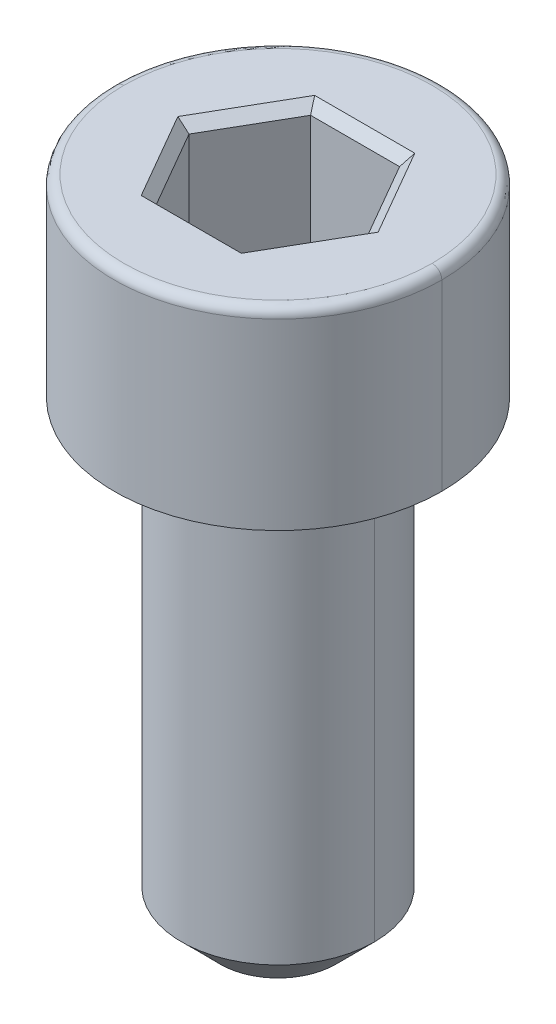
ISO-10303-21;
HEADER;
FILE_DESCRIPTION(('STEP AP214'),'2;1');
FILE_NAME('part.step','',(''),(''),'','','');
FILE_SCHEMA(('AUTOMOTIVE_DESIGN { 1 0 10303 214 1 1 1 1 }'));
ENDSEC;
DATA;
#1=APPLICATION_CONTEXT('core data for automotive mechanical design processes');
#2=APPLICATION_PROTOCOL_DEFINITION('international standard','automotive_design',2000,#1);
#3=PRODUCT_CONTEXT('',#1,'mechanical');
#4=PRODUCT('Part','Part','',(#3));
#5=PRODUCT_RELATED_PRODUCT_CATEGORY('part','',(#4));
#6=PRODUCT_DEFINITION_FORMATION('','',#4);
#7=PRODUCT_DEFINITION_CONTEXT('part definition',#1,'design');
#8=PRODUCT_DEFINITION('design','',#6,#7);
#9=PRODUCT_DEFINITION_SHAPE('','',#8);
#10=(LENGTH_UNIT() NAMED_UNIT(*) SI_UNIT(.MILLI.,.METRE.));
#11=(NAMED_UNIT(*) PLANE_ANGLE_UNIT() SI_UNIT($,.RADIAN.));
#12=(NAMED_UNIT(*) SI_UNIT($,.STERADIAN.) SOLID_ANGLE_UNIT());
#13=UNCERTAINTY_MEASURE_WITH_UNIT(LENGTH_MEASURE(1.E-05),#10,'distance_accuracy_value','');
#14=(GEOMETRIC_REPRESENTATION_CONTEXT(3) GLOBAL_UNCERTAINTY_ASSIGNED_CONTEXT((#13)) GLOBAL_UNIT_ASSIGNED_CONTEXT((#10,
#11,#12)) REPRESENTATION_CONTEXT('',''));
#15=CARTESIAN_POINT('',(0.,0.,0.));
#16=DIRECTION('',(0.,0.,1.));
#17=DIRECTION('',(1.,0.,0.));
#18=AXIS2_PLACEMENT_3D('',#15,#16,#17);
#19=CARTESIAN_POINT('',(-58.8452994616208,56.75,-9.25));
#20=DIRECTION('',(0.,-0.707106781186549,-0.707106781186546));
#21=DIRECTION('',(-1.,0.,0.));
#22=AXIS2_PLACEMENT_3D('',#19,#20,#21);
#23=PLANE('',#22);
#24=DIRECTION('',(0.377964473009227,0.654653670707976,-0.654653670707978));
#25=VECTOR('',#24,1.);
#26=CARTESIAN_POINT('',(-58.8452994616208,56.75,-9.25));
#27=LINE('',#26,#25);
#28=CARTESIAN_POINT('',(-58.8452994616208,56.75,-9.25));
#29=VERTEX_POINT('',#28);
#30=CARTESIAN_POINT('',(-58.7009618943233,57.,-9.5));
#31=VERTEX_POINT('',#30);
#32=EDGE_CURVE('E24',#29,#31,#27,.T.);
#33=ORIENTED_EDGE('',*,*,#32,.T.);
#34=DIRECTION('',(1.,0.,0.));
#35=VECTOR('',#34,1.);
#36=CARTESIAN_POINT('',(-60.,57.,-9.5));
#37=LINE('',#36,#35);
#38=CARTESIAN_POINT('',(-61.2990381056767,57.,-9.5));
#39=VERTEX_POINT('',#38);
#40=EDGE_CURVE('E184',#39,#31,#37,.T.);
#41=ORIENTED_EDGE('',*,*,#40,.F.);
#42=DIRECTION('',(0.377964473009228,-0.654653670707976,0.654653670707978));
#43=VECTOR('',#42,1.);
#44=CARTESIAN_POINT('',(-60.8247860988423,56.1785714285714,-8.67857142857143));
#45=LINE('',#44,#43);
#46=CARTESIAN_POINT('',(-61.1547005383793,56.75,-9.25));
#47=VERTEX_POINT('',#46);
#48=EDGE_CURVE('E11',#39,#47,#45,.T.);
#49=ORIENTED_EDGE('',*,*,#48,.T.);
#50=DIRECTION('',(-1.,0.,0.));
#51=VECTOR('',#50,1.);
#52=CARTESIAN_POINT('',(-58.8452994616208,56.75,-9.25));
#53=LINE('',#52,#51);
#54=EDGE_CURVE('E187',#29,#47,#53,.T.);
#55=ORIENTED_EDGE('',*,*,#54,.F.);
#56=EDGE_LOOP('',(#33,#41,#49,#55));
#57=FACE_BOUND('',#56,.T.);
#58=ADVANCED_FACE('F16',(#57),#23,.F.);
#59=CARTESIAN_POINT('',(-61.1547005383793,56.75,-9.25));
#60=DIRECTION('',(-0.612372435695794,-0.707106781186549,-0.353553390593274));
#61=DIRECTION('',(-0.5,0.,0.866025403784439));
#62=AXIS2_PLACEMENT_3D('',#59,#60,#61);
#63=PLANE('',#62);
#64=DIRECTION('',(0.755928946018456,-0.654653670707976,0.));
#65=VECTOR('',#64,1.);
#66=CARTESIAN_POINT('',(-62.3094010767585,56.75,-7.25));
#67=LINE('',#66,#65);
#68=CARTESIAN_POINT('',(-62.5980762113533,57.,-7.25));
#69=VERTEX_POINT('',#68);
#70=CARTESIAN_POINT('',(-62.3094010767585,56.75,-7.25));
#71=VERTEX_POINT('',#70);
#72=EDGE_CURVE('E193',#69,#71,#67,.T.);
#73=ORIENTED_EDGE('',*,*,#72,.T.);
#74=DIRECTION('',(-0.5,0.,0.866025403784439));
#75=VECTOR('',#74,1.);
#76=CARTESIAN_POINT('',(-61.1547005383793,56.75,-9.25));
#77=LINE('',#76,#75);
#78=EDGE_CURVE('E299',#47,#71,#77,.T.);
#79=ORIENTED_EDGE('',*,*,#78,.F.);
#80=ORIENTED_EDGE('',*,*,#48,.F.);
#81=DIRECTION('',(0.5,0.,-0.866025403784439));
#82=VECTOR('',#81,1.);
#83=CARTESIAN_POINT('',(-61.948557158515,57.,-8.375));
#84=LINE('',#83,#82);
#85=EDGE_CURVE('E209',#69,#39,#84,.T.);
#86=ORIENTED_EDGE('',*,*,#85,.F.);
#87=EDGE_LOOP('',(#73,#79,#80,#86));
#88=FACE_BOUND('',#87,.T.);
#89=ADVANCED_FACE('F526',(#88),#63,.F.);
#90=CARTESIAN_POINT('',(-57.6905989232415,56.75,-7.25));
#91=DIRECTION('',(0.612372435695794,-0.707106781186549,-0.353553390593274));
#92=DIRECTION('',(-0.5,0.,-0.866025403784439));
#93=AXIS2_PLACEMENT_3D('',#90,#91,#92);
#94=PLANE('',#93);
#95=DIRECTION('',(0.755928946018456,0.654653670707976,0.));
#96=VECTOR('',#95,1.);
#97=CARTESIAN_POINT('',(-57.6905989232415,56.75,-7.25));
#98=LINE('',#97,#96);
#99=CARTESIAN_POINT('',(-57.6905989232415,56.75,-7.25));
#100=VERTEX_POINT('',#99);
#101=CARTESIAN_POINT('',(-57.4019237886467,57.,-7.25));
#102=VERTEX_POINT('',#101);
#103=EDGE_CURVE('E198',#100,#102,#98,.T.);
#104=ORIENTED_EDGE('',*,*,#103,.T.);
#105=DIRECTION('',(0.5,0.,0.866025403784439));
#106=VECTOR('',#105,1.);
#107=CARTESIAN_POINT('',(-58.051442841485,57.,-8.375));
#108=LINE('',#107,#106);
#109=EDGE_CURVE('E196',#31,#102,#108,.T.);
#110=ORIENTED_EDGE('',*,*,#109,.F.);
#111=ORIENTED_EDGE('',*,*,#32,.F.);
#112=DIRECTION('',(-0.5,0.,-0.866025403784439));
#113=VECTOR('',#112,1.);
#114=CARTESIAN_POINT('',(-57.6905989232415,56.75,-7.25));
#115=LINE('',#114,#113);
#116=EDGE_CURVE('E261',#100,#29,#115,.T.);
#117=ORIENTED_EDGE('',*,*,#116,.F.);
#118=EDGE_LOOP('',(#104,#110,#111,#117));
#119=FACE_BOUND('',#118,.T.);
#120=ADVANCED_FACE('F197',(#119),#94,.F.);
#121=CARTESIAN_POINT('',(-62.3094010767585,56.75,-7.25));
#122=DIRECTION('',(-0.612372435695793,-0.707106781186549,0.353553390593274));
#123=DIRECTION('',(0.5,0.,0.866025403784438));
#124=AXIS2_PLACEMENT_3D('',#121,#122,#123);
#125=PLANE('',#124);
#126=DIRECTION('',(0.377964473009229,-0.654653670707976,-0.654653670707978));
#127=VECTOR('',#126,1.);
#128=CARTESIAN_POINT('',(-61.1547005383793,56.75,-5.25));
#129=LINE('',#128,#127);
#130=CARTESIAN_POINT('',(-61.2990381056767,57.,-5.));
#131=VERTEX_POINT('',#130);
#132=CARTESIAN_POINT('',(-61.1547005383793,56.75,-5.25));
#133=VERTEX_POINT('',#132);
#134=EDGE_CURVE('E251',#131,#133,#129,.T.);
#135=ORIENTED_EDGE('',*,*,#134,.T.);
#136=DIRECTION('',(0.5,0.,0.866025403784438));
#137=VECTOR('',#136,1.);
#138=CARTESIAN_POINT('',(-62.3094010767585,56.75,-7.25));
#139=LINE('',#138,#137);
#140=EDGE_CURVE('E294',#71,#133,#139,.T.);
#141=ORIENTED_EDGE('',*,*,#140,.F.);
#142=ORIENTED_EDGE('',*,*,#72,.F.);
#143=DIRECTION('',(-0.5,0.,-0.866025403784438));
#144=VECTOR('',#143,1.);
#145=CARTESIAN_POINT('',(-61.948557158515,57.,-6.125));
#146=LINE('',#145,#144);
#147=EDGE_CURVE('E235',#131,#69,#146,.T.);
#148=ORIENTED_EDGE('',*,*,#147,.F.);
#149=EDGE_LOOP('',(#135,#141,#142,#148));
#150=FACE_BOUND('',#149,.T.);
#151=ADVANCED_FACE('F370',(#150),#125,.F.);
#152=CARTESIAN_POINT('',(-58.8452994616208,56.75,-5.25));
#153=DIRECTION('',(0.612372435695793,-0.707106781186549,0.353553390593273));
#154=DIRECTION('',(0.5,0.,-0.866025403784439));
#155=AXIS2_PLACEMENT_3D('',#152,#153,#154);
#156=PLANE('',#155);
#157=DIRECTION('',(0.377964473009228,0.654653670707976,0.654653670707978));
#158=VECTOR('',#157,1.);
#159=CARTESIAN_POINT('',(-58.8452994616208,56.75,-5.25));
#160=LINE('',#159,#158);
#161=CARTESIAN_POINT('',(-58.8452994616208,56.75,-5.25));
#162=VERTEX_POINT('',#161);
#163=CARTESIAN_POINT('',(-58.7009618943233,57.,-5.));
#164=VERTEX_POINT('',#163);
#165=EDGE_CURVE('E248',#162,#164,#160,.T.);
#166=ORIENTED_EDGE('',*,*,#165,.T.);
#167=DIRECTION('',(-0.5,0.,0.866025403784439));
#168=VECTOR('',#167,1.);
#169=CARTESIAN_POINT('',(-58.051442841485,57.,-6.125));
#170=LINE('',#169,#168);
#171=EDGE_CURVE('E203',#102,#164,#170,.T.);
#172=ORIENTED_EDGE('',*,*,#171,.F.);
#173=ORIENTED_EDGE('',*,*,#103,.F.);
#174=DIRECTION('',(0.5,0.,-0.866025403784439));
#175=VECTOR('',#174,1.);
#176=CARTESIAN_POINT('',(-58.8452994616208,56.75,-5.25));
#177=LINE('',#176,#175);
#178=EDGE_CURVE('E270',#162,#100,#177,.T.);
#179=ORIENTED_EDGE('',*,*,#178,.F.);
#180=EDGE_LOOP('',(#166,#172,#173,#179));
#181=FACE_BOUND('',#180,.T.);
#182=ADVANCED_FACE('F552',(#181),#156,.F.);
#183=CARTESIAN_POINT('',(-61.1547005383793,56.75,-5.25));
#184=DIRECTION('',(0.,-0.707106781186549,0.707106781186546));
#185=DIRECTION('',(1.,0.,0.));
#186=AXIS2_PLACEMENT_3D('',#183,#184,#185);
#187=PLANE('',#186);
#188=ORIENTED_EDGE('',*,*,#134,.F.);
#189=DIRECTION('',(-1.,0.,0.));
#190=VECTOR('',#189,1.);
#191=CARTESIAN_POINT('',(-60.,57.,-5.));
#192=LINE('',#191,#190);
#193=EDGE_CURVE('E231',#164,#131,#192,.T.);
#194=ORIENTED_EDGE('',*,*,#193,.F.);
#195=ORIENTED_EDGE('',*,*,#165,.F.);
#196=DIRECTION('',(1.,0.,0.));
#197=VECTOR('',#196,1.);
#198=CARTESIAN_POINT('',(-61.1547005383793,56.75,-5.25));
#199=LINE('',#198,#197);
#200=EDGE_CURVE('E282',#133,#162,#199,.T.);
#201=ORIENTED_EDGE('',*,*,#200,.F.);
#202=EDGE_LOOP('',(#188,#194,#195,#201));
#203=FACE_BOUND('',#202,.T.);
#204=ADVANCED_FACE('F379',(#203),#187,.F.);
#205=CARTESIAN_POINT('',(-57.9071052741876,53.75,-7.375));
#206=DIRECTION('',(0.5,0.,-0.866025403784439));
#207=DIRECTION('',(0.866025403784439,0.,0.5));
#208=AXIS2_PLACEMENT_3D('',#205,#206,#207);
#209=CYLINDRICAL_SURFACE('',#208,0.25);
#210=CARTESIAN_POINT('',(-58.9896370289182,53.5,-5.5));
#211=CARTESIAN_POINT('',(-58.9050860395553,53.5,-5.35355339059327));
#212=CARTESIAN_POINT('',(-58.8452994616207,53.6035533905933,-5.25));
#213=CARTESIAN_POINT('',(-58.8452994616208,53.75,-5.25));
#214=(BOUNDED_CURVE() B_SPLINE_CURVE(3,(#210,#211,#212,#213),.UNSPECIFIED.,.F.,
.F.) B_SPLINE_CURVE_WITH_KNOTS((4,4),(1.5707963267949,3.1415926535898),
.UNSPECIFIED.) CURVE() GEOMETRIC_REPRESENTATION_ITEM() RATIONAL_B_SPLINE_CURVE((1.,
0.804737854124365,0.804737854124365,1.)) REPRESENTATION_ITEM(''));
#215=CARTESIAN_POINT('',(-58.9896370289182,53.5,-5.5));
#216=VERTEX_POINT('',#215);
#217=CARTESIAN_POINT('',(-58.8452994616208,53.75,-5.25));
#218=VERTEX_POINT('',#217);
#219=EDGE_CURVE('E347',#216,#218,#214,.T.);
#220=ORIENTED_EDGE('',*,*,#219,.T.);
#221=DIRECTION('',(-0.5,0.,0.866025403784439));
#222=VECTOR('',#221,1.);
#223=CARTESIAN_POINT('',(-58.8452994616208,53.75,-5.25));
#224=LINE('',#223,#222);
#225=CARTESIAN_POINT('',(-57.6905989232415,53.75,-7.25));
#226=VERTEX_POINT('',#225);
#227=EDGE_CURVE('E274',#226,#218,#224,.T.);
#228=ORIENTED_EDGE('',*,*,#227,.F.);
#229=CARTESIAN_POINT('',(-57.6905989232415,53.75,-7.25));
#230=CARTESIAN_POINT('',(-57.6905989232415,53.6035533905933,-7.24999999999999));
#231=CARTESIAN_POINT('',(-57.8101720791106,53.5,-7.24999999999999));
#232=CARTESIAN_POINT('',(-57.9792740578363,53.5,-7.25));
#233=(BOUNDED_CURVE() B_SPLINE_CURVE(3,(#229,#230,#231,#232),.UNSPECIFIED.,.F.,
.F.) B_SPLINE_CURVE_WITH_KNOTS((4,4),(0.,1.5707963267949),
.UNSPECIFIED.) CURVE() GEOMETRIC_REPRESENTATION_ITEM() RATIONAL_B_SPLINE_CURVE((1.,
0.804737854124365,0.804737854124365,1.)) REPRESENTATION_ITEM(''));
#234=CARTESIAN_POINT('',(-57.9792740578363,53.5,-7.25));
#235=VERTEX_POINT('',#234);
#236=EDGE_CURVE('E355',#226,#235,#233,.T.);
#237=ORIENTED_EDGE('',*,*,#236,.T.);
#238=DIRECTION('',(0.5,0.,-0.866025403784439));
#239=VECTOR('',#238,1.);
#240=CARTESIAN_POINT('',(-57.9071052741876,53.5,-7.375));
#241=LINE('',#240,#239);
#242=EDGE_CURVE('E311',#216,#235,#241,.T.);
#243=ORIENTED_EDGE('',*,*,#242,.F.);
#244=EDGE_LOOP('',(#220,#228,#237,#243));
#245=FACE_BOUND('',#244,.T.);
#246=ADVANCED_FACE('F395',(#245),#209,.F.);
#247=CARTESIAN_POINT('',(-59.6391560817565,53.75,-10.125));
#248=DIRECTION('',(-0.5,0.,-0.866025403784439));
#249=DIRECTION('',(0.866025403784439,0.,-0.5));
#250=AXIS2_PLACEMENT_3D('',#247,#248,#249);
#251=CYLINDRICAL_SURFACE('',#250,0.25);
#252=CARTESIAN_POINT('',(-58.8452994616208,53.75,-9.25));
#253=CARTESIAN_POINT('',(-58.8452994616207,53.6035533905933,-9.24999999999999));
#254=CARTESIAN_POINT('',(-58.9050860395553,53.5,-9.14644660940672));
#255=CARTESIAN_POINT('',(-58.9896370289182,53.5,-9.));
#256=(BOUNDED_CURVE() B_SPLINE_CURVE(3,(#252,#253,#254,#255),.UNSPECIFIED.,.F.,
.F.) B_SPLINE_CURVE_WITH_KNOTS((4,4),(0.,1.5707963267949),
.UNSPECIFIED.) CURVE() GEOMETRIC_REPRESENTATION_ITEM() RATIONAL_B_SPLINE_CURVE((1.,
0.804737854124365,0.804737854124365,1.)) REPRESENTATION_ITEM(''));
#257=CARTESIAN_POINT('',(-58.8452994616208,53.75,-9.25));
#258=VERTEX_POINT('',#257);
#259=CARTESIAN_POINT('',(-58.9896370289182,53.5,-9.));
#260=VERTEX_POINT('',#259);
#261=EDGE_CURVE('E339',#258,#260,#256,.T.);
#262=ORIENTED_EDGE('',*,*,#261,.T.);
#263=DIRECTION('',(-0.5,0.,-0.866025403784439));
#264=VECTOR('',#263,1.);
#265=CARTESIAN_POINT('',(-59.6391560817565,53.5,-10.125));
#266=LINE('',#265,#264);
#267=EDGE_CURVE('E315',#235,#260,#266,.T.);
#268=ORIENTED_EDGE('',*,*,#267,.F.);
#269=ORIENTED_EDGE('',*,*,#236,.F.);
#270=DIRECTION('',(0.5,0.,0.866025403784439));
#271=VECTOR('',#270,1.);
#272=CARTESIAN_POINT('',(-57.6905989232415,53.75,-7.25));
#273=LINE('',#272,#271);
#274=EDGE_CURVE('E262',#258,#226,#273,.T.);
#275=ORIENTED_EDGE('',*,*,#274,.F.);
#276=EDGE_LOOP('',(#262,#268,#269,#275));
#277=FACE_BOUND('',#276,.T.);
#278=ADVANCED_FACE('F402',(#277),#251,.F.);
#279=CARTESIAN_POINT('',(-61.1547005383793,53.75,-5.5));
#280=DIRECTION('',(1.,0.,0.));
#281=DIRECTION('',(0.,0.,1.));
#282=AXIS2_PLACEMENT_3D('',#279,#280,#281);
#283=CYLINDRICAL_SURFACE('',#282,0.25);
#284=CARTESIAN_POINT('',(-61.0103629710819,53.5,-5.5));
#285=CARTESIAN_POINT('',(-61.0949139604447,53.5,-5.35355339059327));
#286=CARTESIAN_POINT('',(-61.1547005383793,53.6035533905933,-5.25));
#287=CARTESIAN_POINT('',(-61.1547005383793,53.75,-5.25));
#288=(BOUNDED_CURVE() B_SPLINE_CURVE(3,(#284,#285,#286,#287),.UNSPECIFIED.,.F.,
.F.) B_SPLINE_CURVE_WITH_KNOTS((4,4),(4.71238898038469,6.28318530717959),
.UNSPECIFIED.) CURVE() GEOMETRIC_REPRESENTATION_ITEM() RATIONAL_B_SPLINE_CURVE((1.,
0.804737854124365,0.804737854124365,1.)) REPRESENTATION_ITEM(''));
#289=CARTESIAN_POINT('',(-61.0103629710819,53.5,-5.5));
#290=VERTEX_POINT('',#289);
#291=CARTESIAN_POINT('',(-61.1547005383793,53.75,-5.25));
#292=VERTEX_POINT('',#291);
#293=EDGE_CURVE('E224',#290,#292,#288,.T.);
#294=ORIENTED_EDGE('',*,*,#293,.T.);
#295=DIRECTION('',(-1.,0.,0.));
#296=VECTOR('',#295,1.);
#297=CARTESIAN_POINT('',(-61.1547005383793,53.75,-5.25));
#298=LINE('',#297,#296);
#299=EDGE_CURVE('E286',#218,#292,#298,.T.);
#300=ORIENTED_EDGE('',*,*,#299,.F.);
#301=ORIENTED_EDGE('',*,*,#219,.F.);
#302=DIRECTION('',(1.,0.,0.));
#303=VECTOR('',#302,1.);
#304=CARTESIAN_POINT('',(-61.1547005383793,53.5,-5.5));
#305=LINE('',#304,#303);
#306=EDGE_CURVE('E307',#290,#216,#305,.T.);
#307=ORIENTED_EDGE('',*,*,#306,.F.);
#308=EDGE_LOOP('',(#294,#300,#301,#307));
#309=FACE_BOUND('',#308,.T.);
#310=ADVANCED_FACE('F386',(#309),#283,.F.);
#311=CARTESIAN_POINT('',(-61.1547005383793,53.75,-9.));
#312=DIRECTION('',(-1.,0.,0.));
#313=DIRECTION('',(0.,-1.,0.));
#314=AXIS2_PLACEMENT_3D('',#311,#312,#313);
#315=CYLINDRICAL_SURFACE('',#314,0.25);
#316=CARTESIAN_POINT('',(-61.1547005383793,53.75,-9.25));
#317=CARTESIAN_POINT('',(-61.1547005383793,53.6035533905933,-9.24999999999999));
#318=CARTESIAN_POINT('',(-61.0949139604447,53.5,-9.14644660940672));
#319=CARTESIAN_POINT('',(-61.0103629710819,53.5,-9.));
#320=(BOUNDED_CURVE() B_SPLINE_CURVE(3,(#316,#317,#318,#319),.UNSPECIFIED.,.F.,
.F.) B_SPLINE_CURVE_WITH_KNOTS((4,4),(0.,1.5707963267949),
.UNSPECIFIED.) CURVE() GEOMETRIC_REPRESENTATION_ITEM() RATIONAL_B_SPLINE_CURVE((1.,
0.804737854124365,0.804737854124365,1.)) REPRESENTATION_ITEM(''));
#321=CARTESIAN_POINT('',(-61.1547005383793,53.75,-9.25));
#322=VERTEX_POINT('',#321);
#323=CARTESIAN_POINT('',(-61.0103629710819,53.5,-9.));
#324=VERTEX_POINT('',#323);
#325=EDGE_CURVE('E45',#322,#324,#320,.T.);
#326=ORIENTED_EDGE('',*,*,#325,.T.);
#327=DIRECTION('',(-1.,0.,0.));
#328=VECTOR('',#327,1.);
#329=CARTESIAN_POINT('',(-61.1547005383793,53.5,-9.));
#330=LINE('',#329,#328);
#331=EDGE_CURVE('E316',#260,#324,#330,.T.);
#332=ORIENTED_EDGE('',*,*,#331,.F.);
#333=ORIENTED_EDGE('',*,*,#261,.F.);
#334=DIRECTION('',(1.,0.,0.));
#335=VECTOR('',#334,1.);
#336=CARTESIAN_POINT('',(-58.8452994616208,53.75,-9.25));
#337=LINE('',#336,#335);
#338=EDGE_CURVE('E247',#322,#258,#337,.T.);
#339=ORIENTED_EDGE('',*,*,#338,.F.);
#340=EDGE_LOOP('',(#326,#332,#333,#339));
#341=FACE_BOUND('',#340,.T.);
#342=ADVANCED_FACE('F406',(#341),#315,.F.);
#343=CARTESIAN_POINT('',(-62.670244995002,53.75,-8.375));
#344=DIRECTION('',(0.5,0.,0.866025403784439));
#345=DIRECTION('',(-0.866025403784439,0.,0.5));
#346=AXIS2_PLACEMENT_3D('',#343,#344,#345);
#347=CYLINDRICAL_SURFACE('',#346,0.25);
#348=CARTESIAN_POINT('',(-62.0207259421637,53.5,-7.25));
#349=CARTESIAN_POINT('',(-62.1898279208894,53.5,-7.25));
#350=CARTESIAN_POINT('',(-62.3094010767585,53.6035533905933,-7.25));
#351=CARTESIAN_POINT('',(-62.3094010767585,53.75,-7.25));
#352=(BOUNDED_CURVE() B_SPLINE_CURVE(3,(#348,#349,#350,#351),.UNSPECIFIED.,.F.,
.F.) B_SPLINE_CURVE_WITH_KNOTS((4,4),(4.71238898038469,6.28318530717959),
.UNSPECIFIED.) CURVE() GEOMETRIC_REPRESENTATION_ITEM() RATIONAL_B_SPLINE_CURVE((1.,
0.804737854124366,0.804737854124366,1.)) REPRESENTATION_ITEM(''));
#353=CARTESIAN_POINT('',(-62.0207259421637,53.5,-7.25));
#354=VERTEX_POINT('',#353);
#355=CARTESIAN_POINT('',(-62.3094010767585,53.75,-7.25));
#356=VERTEX_POINT('',#355);
#357=EDGE_CURVE('E35',#354,#356,#352,.T.);
#358=ORIENTED_EDGE('',*,*,#357,.T.);
#359=DIRECTION('',(-0.5,0.,-0.866025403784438));
#360=VECTOR('',#359,1.);
#361=CARTESIAN_POINT('',(-62.3094010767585,53.75,-7.25));
#362=LINE('',#361,#360);
#363=EDGE_CURVE('E298',#292,#356,#362,.T.);
#364=ORIENTED_EDGE('',*,*,#363,.F.);
#365=ORIENTED_EDGE('',*,*,#293,.F.);
#366=DIRECTION('',(0.5,0.,0.866025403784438));
#367=VECTOR('',#366,1.);
#368=CARTESIAN_POINT('',(-62.670244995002,53.5,-8.375));
#369=LINE('',#368,#367);
#370=EDGE_CURVE('E324',#354,#290,#369,.T.);
#371=ORIENTED_EDGE('',*,*,#370,.F.);
#372=EDGE_LOOP('',(#358,#364,#365,#371));
#373=FACE_BOUND('',#372,.T.);
#374=ADVANCED_FACE('F531',(#373),#347,.F.);
#375=CARTESIAN_POINT('',(-60.9381941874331,53.75,-9.125));
#376=DIRECTION('',(-0.5,0.,0.866025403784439));
#377=DIRECTION('',(-0.866025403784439,0.,-0.5));
#378=AXIS2_PLACEMENT_3D('',#375,#376,#377);
#379=CYLINDRICAL_SURFACE('',#378,0.25);
#380=ORIENTED_EDGE('',*,*,#325,.F.);
#381=DIRECTION('',(0.5,0.,-0.866025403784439));
#382=VECTOR('',#381,1.);
#383=CARTESIAN_POINT('',(-61.1547005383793,53.75,-9.25));
#384=LINE('',#383,#382);
#385=EDGE_CURVE('E303',#356,#322,#384,.T.);
#386=ORIENTED_EDGE('',*,*,#385,.F.);
#387=ORIENTED_EDGE('',*,*,#357,.F.);
#388=DIRECTION('',(-0.5,0.,0.866025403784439));
#389=VECTOR('',#388,1.);
#390=CARTESIAN_POINT('',(-60.9381941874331,53.5,-9.125));
#391=LINE('',#390,#389);
#392=EDGE_CURVE('E320',#324,#354,#391,.T.);
#393=ORIENTED_EDGE('',*,*,#392,.F.);
#394=EDGE_LOOP('',(#380,#386,#387,#393));
#395=FACE_BOUND('',#394,.T.);
#396=ADVANCED_FACE('F529',(#395),#379,.F.);
#397=CARTESIAN_POINT('',(-60.,56.75,-7.25));
#398=DIRECTION('',(0.,-1.,0.));
#399=DIRECTION('',(1.,0.,0.));
#400=AXIS2_PLACEMENT_3D('',#397,#398,#399);
#401=TOROIDAL_SURFACE('',#400,4.,0.25);
#402=CARTESIAN_POINT('',(-64.,56.75,-7.25));
#403=DIRECTION('',(0.,0.,1.));
#404=DIRECTION('',(-1.,0.,0.));
#405=AXIS2_PLACEMENT_3D('',#402,#403,#404);
#406=CIRCLE('',#405,0.25);
#407=CARTESIAN_POINT('',(-64.,57.,-7.25));
#408=VERTEX_POINT('',#407);
#409=CARTESIAN_POINT('',(-64.25,56.75,-7.25));
#410=VERTEX_POINT('',#409);
#411=EDGE_CURVE('E508',#408,#410,#406,.T.);
#412=ORIENTED_EDGE('',*,*,#411,.F.);
#413=CARTESIAN_POINT('',(-60.,57.,-7.25));
#414=DIRECTION('',(0.,1.,0.));
#415=DIRECTION('',(1.,0.,0.));
#416=AXIS2_PLACEMENT_3D('',#413,#414,#415);
#417=CIRCLE('',#416,4.);
#418=CARTESIAN_POINT('',(-56.,57.,-7.25));
#419=VERTEX_POINT('',#418);
#420=EDGE_CURVE('E216',#419,#408,#417,.T.);
#421=ORIENTED_EDGE('',*,*,#420,.F.);
#422=CARTESIAN_POINT('',(-56.,56.75,-7.25));
#423=DIRECTION('',(0.,0.,-1.));
#424=DIRECTION('',(0.,1.,0.));
#425=AXIS2_PLACEMENT_3D('',#422,#423,#424);
#426=CIRCLE('',#425,0.25);
#427=CARTESIAN_POINT('',(-55.75,56.75,-7.25));
#428=VERTEX_POINT('',#427);
#429=EDGE_CURVE('E500',#419,#428,#426,.T.);
#430=ORIENTED_EDGE('',*,*,#429,.T.);
#431=CARTESIAN_POINT('',(-60.,56.75,-7.25));
#432=DIRECTION('',(0.,-1.,0.));
#433=DIRECTION('',(1.,0.,0.));
#434=AXIS2_PLACEMENT_3D('',#431,#432,#433);
#435=CIRCLE('',#434,4.25);
#436=EDGE_CURVE('E220',#410,#428,#435,.T.);
#437=ORIENTED_EDGE('',*,*,#436,.F.);
#438=EDGE_LOOP('',(#412,#421,#430,#437));
#439=FACE_BOUND('',#438,.T.);
#440=ADVANCED_FACE('F502',(#439),#401,.T.);
#441=CARTESIAN_POINT('',(-60.,40.,-7.25));
#442=DIRECTION('',(0.,1.,0.));
#443=DIRECTION('',(-1.,0.,0.));
#444=AXIS2_PLACEMENT_3D('',#441,#442,#443);
#445=CONICAL_SURFACE('',#444,1.5,0.785398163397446);
#446=DIRECTION('',(0.707106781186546,0.70710678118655,0.));
#447=VECTOR('',#446,1.);
#448=CARTESIAN_POINT('',(-58.5,40.,-7.25));
#449=LINE('',#448,#447);
#450=CARTESIAN_POINT('',(-58.5,40.,-7.25));
#451=VERTEX_POINT('',#450);
#452=CARTESIAN_POINT('',(-57.5,41.,-7.25));
#453=VERTEX_POINT('',#452);
#454=EDGE_CURVE('E451',#451,#453,#449,.T.);
#455=ORIENTED_EDGE('',*,*,#454,.F.);
#456=CARTESIAN_POINT('',(-60.,40.,-7.25));
#457=DIRECTION('',(0.,-1.,0.));
#458=DIRECTION('',(1.,0.,0.));
#459=AXIS2_PLACEMENT_3D('',#456,#457,#458);
#460=CIRCLE('',#459,1.5);
#461=CARTESIAN_POINT('',(-61.5,40.,-7.25));
#462=VERTEX_POINT('',#461);
#463=EDGE_CURVE('E416',#462,#451,#460,.T.);
#464=ORIENTED_EDGE('',*,*,#463,.F.);
#465=DIRECTION('',(-0.707106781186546,0.70710678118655,0.));
#466=VECTOR('',#465,1.);
#467=CARTESIAN_POINT('',(-61.5,40.,-7.25));
#468=LINE('',#467,#466);
#469=CARTESIAN_POINT('',(-62.5,41.,-7.25));
#470=VERTEX_POINT('',#469);
#471=EDGE_CURVE('E459',#462,#470,#468,.T.);
#472=ORIENTED_EDGE('',*,*,#471,.T.);
#473=CARTESIAN_POINT('',(-60.,41.,-7.25));
#474=DIRECTION('',(0.,1.,0.));
#475=DIRECTION('',(1.,0.,0.));
#476=AXIS2_PLACEMENT_3D('',#473,#474,#475);
#477=CIRCLE('',#476,2.5);
#478=EDGE_CURVE('E430',#453,#470,#477,.T.);
#479=ORIENTED_EDGE('',*,*,#478,.F.);
#480=EDGE_LOOP('',(#455,#464,#472,#479));
#481=FACE_BOUND('',#480,.T.);
#482=ADVANCED_FACE('F595',(#481),#445,.T.);
#483=CARTESIAN_POINT('',(-61.1547005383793,53.5,-9.25));
#484=DIRECTION('',(0.,1.,0.));
#485=DIRECTION('',(0.,0.,-1.));
#486=AXIS2_PLACEMENT_3D('',#483,#484,#485);
#487=PLANE('',#486);
#488=ORIENTED_EDGE('',*,*,#306,.T.);
#489=ORIENTED_EDGE('',*,*,#242,.T.);
#490=ORIENTED_EDGE('',*,*,#267,.T.);
#491=ORIENTED_EDGE('',*,*,#331,.T.);
#492=ORIENTED_EDGE('',*,*,#392,.T.);
#493=ORIENTED_EDGE('',*,*,#370,.T.);
#494=EDGE_LOOP('',(#488,#489,#490,#491,#492,#493));
#495=FACE_BOUND('',#494,.T.);
#496=ADVANCED_FACE('F409',(#495),#487,.T.);
#497=CARTESIAN_POINT('',(-61.1547005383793,53.5,-9.25));
#498=DIRECTION('',(-0.866025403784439,0.,-0.5));
#499=DIRECTION('',(-0.5,0.,0.866025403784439));
#500=AXIS2_PLACEMENT_3D('',#497,#498,#499);
#501=PLANE('',#500);
#502=DIRECTION('',(0.,1.,0.));
#503=VECTOR('',#502,1.);
#504=CARTESIAN_POINT('',(-61.1547005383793,53.5,-9.25));
#505=LINE('',#504,#503);
#506=EDGE_CURVE('E243',#322,#47,#505,.T.);
#507=ORIENTED_EDGE('',*,*,#506,.T.);
#508=ORIENTED_EDGE('',*,*,#78,.T.);
#509=DIRECTION('',(0.,1.,0.));
#510=VECTOR('',#509,1.);
#511=CARTESIAN_POINT('',(-62.3094010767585,53.5,-7.25));
#512=LINE('',#511,#510);
#513=EDGE_CURVE('E290',#356,#71,#512,.T.);
#514=ORIENTED_EDGE('',*,*,#513,.F.);
#515=ORIENTED_EDGE('',*,*,#385,.T.);
#516=EDGE_LOOP('',(#507,#508,#514,#515));
#517=FACE_BOUND('',#516,.T.);
#518=ADVANCED_FACE('F528',(#517),#501,.F.);
#519=CARTESIAN_POINT('',(-62.3094010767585,53.5,-7.25));
#520=DIRECTION('',(-0.866025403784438,0.,0.5));
#521=DIRECTION('',(0.,-1.,0.));
#522=AXIS2_PLACEMENT_3D('',#519,#520,#521);
#523=PLANE('',#522);
#524=ORIENTED_EDGE('',*,*,#513,.T.);
#525=ORIENTED_EDGE('',*,*,#140,.T.);
#526=DIRECTION('',(0.,1.,0.));
#527=VECTOR('',#526,1.);
#528=CARTESIAN_POINT('',(-61.1547005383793,53.5,-5.25));
#529=LINE('',#528,#527);
#530=EDGE_CURVE('E278',#292,#133,#529,.T.);
#531=ORIENTED_EDGE('',*,*,#530,.F.);
#532=ORIENTED_EDGE('',*,*,#363,.T.);
#533=EDGE_LOOP('',(#524,#525,#531,#532));
#534=FACE_BOUND('',#533,.T.);
#535=ADVANCED_FACE('F376',(#534),#523,.F.);
#536=CARTESIAN_POINT('',(-61.1547005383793,53.5,-5.25));
#537=DIRECTION('',(0.,0.,1.));
#538=DIRECTION('',(1.,0.,0.));
#539=AXIS2_PLACEMENT_3D('',#536,#537,#538);
#540=PLANE('',#539);
#541=ORIENTED_EDGE('',*,*,#530,.T.);
#542=ORIENTED_EDGE('',*,*,#200,.T.);
#543=DIRECTION('',(0.,1.,0.));
#544=VECTOR('',#543,1.);
#545=CARTESIAN_POINT('',(-58.8452994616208,53.5,-5.25));
#546=LINE('',#545,#544);
#547=EDGE_CURVE('E266',#218,#162,#546,.T.);
#548=ORIENTED_EDGE('',*,*,#547,.F.);
#549=ORIENTED_EDGE('',*,*,#299,.T.);
#550=EDGE_LOOP('',(#541,#542,#548,#549));
#551=FACE_BOUND('',#550,.T.);
#552=ADVANCED_FACE('F383',(#551),#540,.F.);
#553=CARTESIAN_POINT('',(-58.8452994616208,53.5,-5.25));
#554=DIRECTION('',(0.866025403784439,0.,0.5));
#555=DIRECTION('',(0.,1.,0.));
#556=AXIS2_PLACEMENT_3D('',#553,#554,#555);
#557=PLANE('',#556);
#558=ORIENTED_EDGE('',*,*,#547,.T.);
#559=ORIENTED_EDGE('',*,*,#178,.T.);
#560=DIRECTION('',(0.,1.,0.));
#561=VECTOR('',#560,1.);
#562=CARTESIAN_POINT('',(-57.6905989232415,53.5,-7.25));
#563=LINE('',#562,#561);
#564=EDGE_CURVE('E255',#226,#100,#563,.T.);
#565=ORIENTED_EDGE('',*,*,#564,.F.);
#566=ORIENTED_EDGE('',*,*,#227,.T.);
#567=EDGE_LOOP('',(#558,#559,#565,#566));
#568=FACE_BOUND('',#567,.T.);
#569=ADVANCED_FACE('F393',(#568),#557,.F.);
#570=CARTESIAN_POINT('',(-57.6905989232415,53.5,-7.25));
#571=DIRECTION('',(0.866025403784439,0.,-0.5));
#572=DIRECTION('',(0.,1.,0.));
#573=AXIS2_PLACEMENT_3D('',#570,#571,#572);
#574=PLANE('',#573);
#575=ORIENTED_EDGE('',*,*,#564,.T.);
#576=ORIENTED_EDGE('',*,*,#116,.T.);
#577=DIRECTION('',(0.,1.,0.));
#578=VECTOR('',#577,1.);
#579=CARTESIAN_POINT('',(-58.8452994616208,53.5,-9.25));
#580=LINE('',#579,#578);
#581=EDGE_CURVE('E238',#258,#29,#580,.T.);
#582=ORIENTED_EDGE('',*,*,#581,.F.);
#583=ORIENTED_EDGE('',*,*,#274,.T.);
#584=EDGE_LOOP('',(#575,#576,#582,#583));
#585=FACE_BOUND('',#584,.T.);
#586=ADVANCED_FACE('F400',(#585),#574,.F.);
#587=CARTESIAN_POINT('',(-58.8452994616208,53.5,-9.25));
#588=DIRECTION('',(0.,0.,-1.));
#589=DIRECTION('',(0.,1.,0.));
#590=AXIS2_PLACEMENT_3D('',#587,#588,#589);
#591=PLANE('',#590);
#592=ORIENTED_EDGE('',*,*,#581,.T.);
#593=ORIENTED_EDGE('',*,*,#54,.T.);
#594=ORIENTED_EDGE('',*,*,#506,.F.);
#595=ORIENTED_EDGE('',*,*,#338,.T.);
#596=EDGE_LOOP('',(#592,#593,#594,#595));
#597=FACE_BOUND('',#596,.T.);
#598=ADVANCED_FACE('F405',(#597),#591,.F.);
#599=CARTESIAN_POINT('',(-60.,57.,-7.25));
#600=DIRECTION('',(0.,-1.,0.));
#601=DIRECTION('',(1.,0.,0.));
#602=AXIS2_PLACEMENT_3D('',#599,#600,#601);
#603=PLANE('',#602);
#604=ORIENTED_EDGE('',*,*,#85,.T.);
#605=ORIENTED_EDGE('',*,*,#40,.T.);
#606=ORIENTED_EDGE('',*,*,#109,.T.);
#607=ORIENTED_EDGE('',*,*,#171,.T.);
#608=ORIENTED_EDGE('',*,*,#193,.T.);
#609=ORIENTED_EDGE('',*,*,#147,.T.);
#610=EDGE_LOOP('',(#604,#605,#606,#607,#608,#609));
#611=FACE_BOUND('',#610,.T.);
#612=ORIENTED_EDGE('',*,*,#420,.T.);
#613=CARTESIAN_POINT('',(-60.,57.,-7.25));
#614=DIRECTION('',(0.,1.,0.));
#615=DIRECTION('',(1.,0.,0.));
#616=AXIS2_PLACEMENT_3D('',#613,#614,#615);
#617=CIRCLE('',#616,4.);
#618=EDGE_CURVE('E513',#408,#419,#617,.T.);
#619=ORIENTED_EDGE('',*,*,#618,.T.);
#620=EDGE_LOOP('',(#612,#619));
#621=FACE_BOUND('',#620,.T.);
#622=ADVANCED_FACE('F205',(#611,#621),#603,.F.);
#623=CARTESIAN_POINT('',(-60.,57.,-7.25));
#624=DIRECTION('',(0.,-1.,0.));
#625=DIRECTION('',(1.,0.,0.));
#626=AXIS2_PLACEMENT_3D('',#623,#624,#625);
#627=CYLINDRICAL_SURFACE('',#626,4.25);
#628=DIRECTION('',(0.,-1.,0.));
#629=VECTOR('',#628,1.);
#630=CARTESIAN_POINT('',(-64.25,57.,-7.25));
#631=LINE('',#630,#629);
#632=CARTESIAN_POINT('',(-64.25,52.,-7.25));
#633=VERTEX_POINT('',#632);
#634=EDGE_CURVE('E463',#410,#633,#631,.T.);
#635=ORIENTED_EDGE('',*,*,#634,.F.);
#636=ORIENTED_EDGE('',*,*,#436,.T.);
#637=DIRECTION('',(0.,-1.,0.));
#638=VECTOR('',#637,1.);
#639=CARTESIAN_POINT('',(-55.75,57.,-7.25));
#640=LINE('',#639,#638);
#641=CARTESIAN_POINT('',(-55.75,52.,-7.25));
#642=VERTEX_POINT('',#641);
#643=EDGE_CURVE('E450',#428,#642,#640,.T.);
#644=ORIENTED_EDGE('',*,*,#643,.T.);
#645=CARTESIAN_POINT('',(-60.,52.,-7.25));
#646=DIRECTION('',(0.,-1.,0.));
#647=DIRECTION('',(1.,0.,0.));
#648=AXIS2_PLACEMENT_3D('',#645,#646,#647);
#649=CIRCLE('',#648,4.25);
#650=EDGE_CURVE('E418',#633,#642,#649,.T.);
#651=ORIENTED_EDGE('',*,*,#650,.F.);
#652=EDGE_LOOP('',(#635,#636,#644,#651));
#653=FACE_BOUND('',#652,.T.);
#654=ADVANCED_FACE('F485',(#653),#627,.T.);
#655=CARTESIAN_POINT('',(-60.,52.,-7.25));
#656=DIRECTION('',(0.,-1.,0.));
#657=DIRECTION('',(1.,0.,0.));
#658=AXIS2_PLACEMENT_3D('',#655,#656,#657);
#659=PLANE('',#658);
#660=CARTESIAN_POINT('',(-60.,52.,-7.25));
#661=DIRECTION('',(0.,-1.,0.));
#662=DIRECTION('',(1.,0.,0.));
#663=AXIS2_PLACEMENT_3D('',#660,#661,#662);
#664=CIRCLE('',#663,2.5);
#665=CARTESIAN_POINT('',(-62.5,52.,-7.25));
#666=VERTEX_POINT('',#665);
#667=CARTESIAN_POINT('',(-57.5,52.,-7.25));
#668=VERTEX_POINT('',#667);
#669=EDGE_CURVE('E423',#666,#668,#664,.T.);
#670=ORIENTED_EDGE('',*,*,#669,.F.);
#671=CARTESIAN_POINT('',(-60.,52.,-7.25));
#672=DIRECTION('',(0.,-1.,0.));
#673=DIRECTION('',(1.,0.,0.));
#674=AXIS2_PLACEMENT_3D('',#671,#672,#673);
#675=CIRCLE('',#674,2.5);
#676=EDGE_CURVE('E449',#668,#666,#675,.T.);
#677=ORIENTED_EDGE('',*,*,#676,.F.);
#678=EDGE_LOOP('',(#670,#677));
#679=FACE_BOUND('',#678,.T.);
#680=CARTESIAN_POINT('',(-60.,52.,-7.25));
#681=DIRECTION('',(0.,-1.,0.));
#682=DIRECTION('',(1.,0.,0.));
#683=AXIS2_PLACEMENT_3D('',#680,#681,#682);
#684=CIRCLE('',#683,4.25);
#685=EDGE_CURVE('E467',#642,#633,#684,.T.);
#686=ORIENTED_EDGE('',*,*,#685,.T.);
#687=ORIENTED_EDGE('',*,*,#650,.T.);
#688=EDGE_LOOP('',(#686,#687));
#689=FACE_BOUND('',#688,.T.);
#690=ADVANCED_FACE('F482',(#679,#689),#659,.T.);
#691=CARTESIAN_POINT('',(-60.,40.,-7.25));
#692=DIRECTION('',(0.,-1.,0.));
#693=DIRECTION('',(1.,0.,0.));
#694=AXIS2_PLACEMENT_3D('',#691,#692,#693);
#695=PLANE('',#694);
#696=ORIENTED_EDGE('',*,*,#463,.T.);
#697=CARTESIAN_POINT('',(-60.,40.,-7.25));
#698=DIRECTION('',(0.,-1.,0.));
#699=DIRECTION('',(1.,0.,0.));
#700=AXIS2_PLACEMENT_3D('',#697,#698,#699);
#701=CIRCLE('',#700,1.5);
#702=EDGE_CURVE('E444',#451,#462,#701,.T.);
#703=ORIENTED_EDGE('',*,*,#702,.T.);
#704=EDGE_LOOP('',(#696,#703));
#705=FACE_BOUND('',#704,.T.);
#706=ADVANCED_FACE('F484',(#705),#695,.T.);
#707=CARTESIAN_POINT('',(-60.,40.,-7.25));
#708=DIRECTION('',(0.,1.,0.));
#709=DIRECTION('',(-1.,0.,0.));
#710=AXIS2_PLACEMENT_3D('',#707,#708,#709);
#711=CYLINDRICAL_SURFACE('',#710,2.5);
#712=DIRECTION('',(0.,1.,0.));
#713=VECTOR('',#712,1.);
#714=CARTESIAN_POINT('',(-57.5,40.,-7.25));
#715=LINE('',#714,#713);
#716=EDGE_CURVE('E446',#453,#668,#715,.T.);
#717=ORIENTED_EDGE('',*,*,#716,.F.);
#718=ORIENTED_EDGE('',*,*,#478,.T.);
#719=DIRECTION('',(0.,1.,0.));
#720=VECTOR('',#719,1.);
#721=CARTESIAN_POINT('',(-62.5,40.,-7.25));
#722=LINE('',#721,#720);
#723=EDGE_CURVE('E440',#470,#666,#722,.T.);
#724=ORIENTED_EDGE('',*,*,#723,.T.);
#725=ORIENTED_EDGE('',*,*,#669,.T.);
#726=EDGE_LOOP('',(#717,#718,#724,#725));
#727=FACE_BOUND('',#726,.T.);
#728=ADVANCED_FACE('F478',(#727),#711,.T.);
#729=CARTESIAN_POINT('',(-60.,40.,-7.25));
#730=DIRECTION('',(0.,1.,0.));
#731=DIRECTION('',(-1.,0.,0.));
#732=AXIS2_PLACEMENT_3D('',#729,#730,#731);
#733=CYLINDRICAL_SURFACE('',#732,2.5);
#734=CARTESIAN_POINT('',(-60.,41.,-7.25));
#735=DIRECTION('',(0.,1.,0.));
#736=DIRECTION('',(1.,0.,0.));
#737=AXIS2_PLACEMENT_3D('',#734,#735,#736);
#738=CIRCLE('',#737,2.5);
#739=EDGE_CURVE('E454',#470,#453,#738,.T.);
#740=ORIENTED_EDGE('',*,*,#739,.T.);
#741=ORIENTED_EDGE('',*,*,#716,.T.);
#742=ORIENTED_EDGE('',*,*,#676,.T.);
#743=ORIENTED_EDGE('',*,*,#723,.F.);
#744=EDGE_LOOP('',(#740,#741,#742,#743));
#745=FACE_BOUND('',#744,.T.);
#746=ADVANCED_FACE('F480',(#745),#733,.T.);
#747=CARTESIAN_POINT('',(-60.,57.,-7.25));
#748=DIRECTION('',(0.,-1.,0.));
#749=DIRECTION('',(1.,0.,0.));
#750=AXIS2_PLACEMENT_3D('',#747,#748,#749);
#751=CYLINDRICAL_SURFACE('',#750,4.25);
#752=CARTESIAN_POINT('',(-60.,56.75,-7.25));
#753=DIRECTION('',(0.,-1.,0.));
#754=DIRECTION('',(1.,0.,0.));
#755=AXIS2_PLACEMENT_3D('',#752,#753,#754);
#756=CIRCLE('',#755,4.25);
#757=EDGE_CURVE('E494',#428,#410,#756,.T.);
#758=ORIENTED_EDGE('',*,*,#757,.T.);
#759=ORIENTED_EDGE('',*,*,#634,.T.);
#760=ORIENTED_EDGE('',*,*,#685,.F.);
#761=ORIENTED_EDGE('',*,*,#643,.F.);
#762=EDGE_LOOP('',(#758,#759,#760,#761));
#763=FACE_BOUND('',#762,.T.);
#764=ADVANCED_FACE('F492',(#763),#751,.T.);
#765=CARTESIAN_POINT('',(-60.,40.,-7.25));
#766=DIRECTION('',(0.,1.,0.));
#767=DIRECTION('',(-1.,0.,0.));
#768=AXIS2_PLACEMENT_3D('',#765,#766,#767);
#769=CONICAL_SURFACE('',#768,1.5,0.785398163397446);
#770=ORIENTED_EDGE('',*,*,#702,.F.);
#771=ORIENTED_EDGE('',*,*,#454,.T.);
#772=ORIENTED_EDGE('',*,*,#739,.F.);
#773=ORIENTED_EDGE('',*,*,#471,.F.);
#774=EDGE_LOOP('',(#770,#771,#772,#773));
#775=FACE_BOUND('',#774,.T.);
#776=ADVANCED_FACE('F730',(#775),#769,.T.);
#777=CARTESIAN_POINT('',(-60.,56.75,-7.25));
#778=DIRECTION('',(0.,-1.,0.));
#779=DIRECTION('',(1.,0.,0.));
#780=AXIS2_PLACEMENT_3D('',#777,#778,#779);
#781=TOROIDAL_SURFACE('',#780,4.,0.25);
#782=ORIENTED_EDGE('',*,*,#618,.F.);
#783=ORIENTED_EDGE('',*,*,#411,.T.);
#784=ORIENTED_EDGE('',*,*,#757,.F.);
#785=ORIENTED_EDGE('',*,*,#429,.F.);
#786=EDGE_LOOP('',(#782,#783,#784,#785));
#787=FACE_BOUND('',#786,.T.);
#788=ADVANCED_FACE('F507',(#787),#781,.T.);
#789=CLOSED_SHELL('',(#58,#89,#120,#151,#182,#204,#246,#278,#310,#342,#374,#396,#440,#482,#496,
#518,#535,#552,#569,#586,#598,#622,#654,#690,#706,#728,#746,#764,#776,#788));
#790=MANIFOLD_SOLID_BREP('B1',#789);
#791=ADVANCED_BREP_SHAPE_REPRESENTATION('',(#18,#790),#14);
#792=SHAPE_DEFINITION_REPRESENTATION(#9,#791);
ENDSEC;
END-ISO-10303-21;
